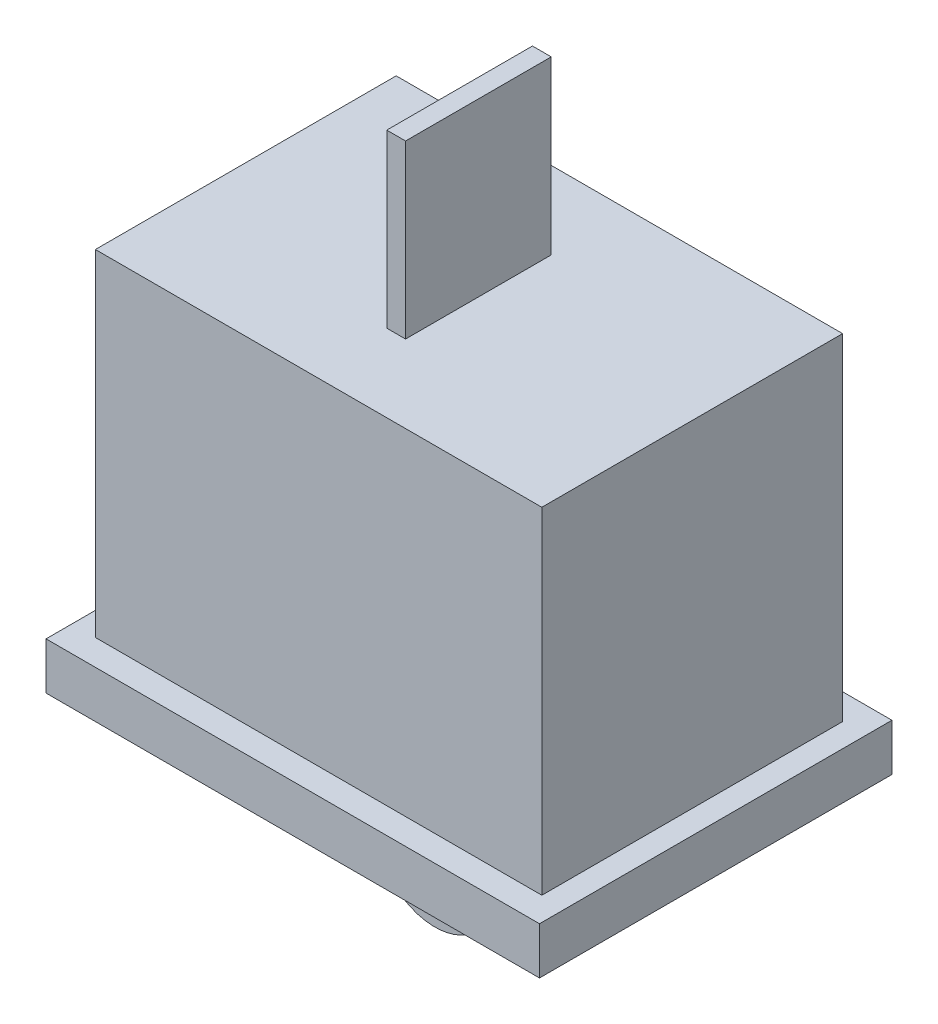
ISO-10303-21;
HEADER;
FILE_DESCRIPTION(('STEP AP214'),'2;1');
FILE_NAME('part.step','',(''),(''),'','','');
FILE_SCHEMA(('AUTOMOTIVE_DESIGN { 1 0 10303 214 1 1 1 1 }'));
ENDSEC;
DATA;
#1=APPLICATION_CONTEXT('core data for automotive mechanical design processes');
#2=APPLICATION_PROTOCOL_DEFINITION('international standard','automotive_design',2000,#1);
#3=PRODUCT_CONTEXT('',#1,'mechanical');
#4=PRODUCT('Part','Part','',(#3));
#5=PRODUCT_RELATED_PRODUCT_CATEGORY('part','',(#4));
#6=PRODUCT_DEFINITION_FORMATION('','',#4);
#7=PRODUCT_DEFINITION_CONTEXT('part definition',#1,'design');
#8=PRODUCT_DEFINITION('design','',#6,#7);
#9=PRODUCT_DEFINITION_SHAPE('','',#8);
#10=(LENGTH_UNIT() NAMED_UNIT(*) SI_UNIT(.MILLI.,.METRE.));
#11=(NAMED_UNIT(*) PLANE_ANGLE_UNIT() SI_UNIT($,.RADIAN.));
#12=(NAMED_UNIT(*) SI_UNIT($,.STERADIAN.) SOLID_ANGLE_UNIT());
#13=UNCERTAINTY_MEASURE_WITH_UNIT(LENGTH_MEASURE(1.E-05),#10,'distance_accuracy_value','');
#14=(GEOMETRIC_REPRESENTATION_CONTEXT(3) GLOBAL_UNCERTAINTY_ASSIGNED_CONTEXT((#13)) GLOBAL_UNIT_ASSIGNED_CONTEXT((#10,
#11,#12)) REPRESENTATION_CONTEXT('',''));
#15=CARTESIAN_POINT('',(0.,0.,0.));
#16=DIRECTION('',(0.,0.,1.));
#17=DIRECTION('',(1.,0.,0.));
#18=AXIS2_PLACEMENT_3D('',#15,#16,#17);
#19=CARTESIAN_POINT('',(0.,16.3,0.));
#20=DIRECTION('',(0.,1.,0.));
#21=DIRECTION('',(0.,0.,1.));
#22=AXIS2_PLACEMENT_3D('',#19,#20,#21);
#23=PLANE('',#22);
#24=DIRECTION('',(0.,0.,-1.));
#25=VECTOR('',#24,1.);
#26=CARTESIAN_POINT('',(9.5,16.3,-6.4));
#27=LINE('',#26,#25);
#28=CARTESIAN_POINT('',(9.5,16.3,6.4));
#29=VERTEX_POINT('',#28);
#30=CARTESIAN_POINT('',(9.5,16.3,-6.4));
#31=VERTEX_POINT('',#30);
#32=EDGE_CURVE('E198',#29,#31,#27,.T.);
#33=ORIENTED_EDGE('',*,*,#32,.T.);
#34=DIRECTION('',(-1.,0.,0.));
#35=VECTOR('',#34,1.);
#36=CARTESIAN_POINT('',(-9.5,16.3,-6.4));
#37=LINE('',#36,#35);
#38=CARTESIAN_POINT('',(-9.5,16.3,-6.4));
#39=VERTEX_POINT('',#38);
#40=EDGE_CURVE('E201',#31,#39,#37,.T.);
#41=ORIENTED_EDGE('',*,*,#40,.T.);
#42=DIRECTION('',(0.,0.,1.));
#43=VECTOR('',#42,1.);
#44=CARTESIAN_POINT('',(-9.5,16.3,-6.4));
#45=LINE('',#44,#43);
#46=CARTESIAN_POINT('',(-9.5,16.3,6.4));
#47=VERTEX_POINT('',#46);
#48=EDGE_CURVE('E204',#39,#47,#45,.T.);
#49=ORIENTED_EDGE('',*,*,#48,.T.);
#50=DIRECTION('',(1.,0.,0.));
#51=VECTOR('',#50,1.);
#52=CARTESIAN_POINT('',(-9.5,16.3,6.4));
#53=LINE('',#52,#51);
#54=EDGE_CURVE('E206',#47,#29,#53,.T.);
#55=ORIENTED_EDGE('',*,*,#54,.T.);
#56=EDGE_LOOP('',(#33,#41,#49,#55));
#57=FACE_BOUND('',#56,.T.);
#58=DIRECTION('',(-1.,0.,0.));
#59=VECTOR('',#58,1.);
#60=CARTESIAN_POINT('',(-0.400000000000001,16.3,-3.1));
#61=LINE('',#60,#59);
#62=CARTESIAN_POINT('',(0.4,16.3,-3.1));
#63=VERTEX_POINT('',#62);
#64=CARTESIAN_POINT('',(-0.400000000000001,16.3,-3.1));
#65=VERTEX_POINT('',#64);
#66=EDGE_CURVE('E167',#63,#65,#61,.T.);
#67=ORIENTED_EDGE('',*,*,#66,.F.);
#68=DIRECTION('',(0.,0.,-1.));
#69=VECTOR('',#68,1.);
#70=CARTESIAN_POINT('',(0.4,16.3,-3.1));
#71=LINE('',#70,#69);
#72=CARTESIAN_POINT('',(0.4,16.3,3.1));
#73=VERTEX_POINT('',#72);
#74=EDGE_CURVE('E164',#73,#63,#71,.T.);
#75=ORIENTED_EDGE('',*,*,#74,.F.);
#76=DIRECTION('',(1.,0.,0.));
#77=VECTOR('',#76,1.);
#78=CARTESIAN_POINT('',(-0.4,16.3,3.1));
#79=LINE('',#78,#77);
#80=CARTESIAN_POINT('',(-0.4,16.3,3.1));
#81=VERTEX_POINT('',#80);
#82=EDGE_CURVE('E176',#81,#73,#79,.T.);
#83=ORIENTED_EDGE('',*,*,#82,.F.);
#84=DIRECTION('',(0.,0.,1.));
#85=VECTOR('',#84,1.);
#86=CARTESIAN_POINT('',(-0.400000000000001,16.3,-3.1));
#87=LINE('',#86,#85);
#88=EDGE_CURVE('E184',#65,#81,#87,.T.);
#89=ORIENTED_EDGE('',*,*,#88,.F.);
#90=EDGE_LOOP('',(#67,#75,#83,#89));
#91=FACE_BOUND('',#90,.T.);
#92=ADVANCED_FACE('F40',(#57,#91),#23,.T.);
#93=CARTESIAN_POINT('',(10.5,2.,-7.5));
#94=DIRECTION('',(-1.,0.,0.));
#95=DIRECTION('',(0.,0.,1.));
#96=AXIS2_PLACEMENT_3D('',#93,#94,#95);
#97=PLANE('',#96);
#98=DIRECTION('',(0.,0.,-1.));
#99=VECTOR('',#98,1.);
#100=CARTESIAN_POINT('',(10.5,0.,-7.5));
#101=LINE('',#100,#99);
#102=CARTESIAN_POINT('',(10.5,0.,7.5));
#103=VERTEX_POINT('',#102);
#104=CARTESIAN_POINT('',(10.5,0.,-7.5));
#105=VERTEX_POINT('',#104);
#106=EDGE_CURVE('E230',#103,#105,#101,.T.);
#107=ORIENTED_EDGE('',*,*,#106,.T.);
#108=DIRECTION('',(0.,-1.,0.));
#109=VECTOR('',#108,1.);
#110=CARTESIAN_POINT('',(10.5,2.,-7.5));
#111=LINE('',#110,#109);
#112=CARTESIAN_POINT('',(10.5,2.,-7.5));
#113=VERTEX_POINT('',#112);
#114=EDGE_CURVE('E11',#113,#105,#111,.T.);
#115=ORIENTED_EDGE('',*,*,#114,.F.);
#116=DIRECTION('',(0.,0.,-1.));
#117=VECTOR('',#116,1.);
#118=CARTESIAN_POINT('',(10.5,2.,-7.5));
#119=LINE('',#118,#117);
#120=CARTESIAN_POINT('',(10.5,2.,7.5));
#121=VERTEX_POINT('',#120);
#122=EDGE_CURVE('E231',#121,#113,#119,.T.);
#123=ORIENTED_EDGE('',*,*,#122,.F.);
#124=DIRECTION('',(0.,-1.,0.));
#125=VECTOR('',#124,1.);
#126=CARTESIAN_POINT('',(10.5,2.,7.5));
#127=LINE('',#126,#125);
#128=EDGE_CURVE('E241',#121,#103,#127,.T.);
#129=ORIENTED_EDGE('',*,*,#128,.T.);
#130=EDGE_LOOP('',(#107,#115,#123,#129));
#131=FACE_BOUND('',#130,.T.);
#132=ADVANCED_FACE('F42',(#131),#97,.F.);
#133=CARTESIAN_POINT('',(-10.5,2.,-7.5));
#134=DIRECTION('',(0.,0.,1.));
#135=DIRECTION('',(1.,0.,0.));
#136=AXIS2_PLACEMENT_3D('',#133,#134,#135);
#137=PLANE('',#136);
#138=DIRECTION('',(-1.,0.,0.));
#139=VECTOR('',#138,1.);
#140=CARTESIAN_POINT('',(-10.5,0.,-7.5));
#141=LINE('',#140,#139);
#142=CARTESIAN_POINT('',(-10.5,0.,-7.5));
#143=VERTEX_POINT('',#142);
#144=EDGE_CURVE('E244',#105,#143,#141,.T.);
#145=ORIENTED_EDGE('',*,*,#144,.T.);
#146=DIRECTION('',(0.,-1.,0.));
#147=VECTOR('',#146,1.);
#148=CARTESIAN_POINT('',(-10.5,2.,-7.5));
#149=LINE('',#148,#147);
#150=CARTESIAN_POINT('',(-10.5,2.,-7.5));
#151=VERTEX_POINT('',#150);
#152=EDGE_CURVE('E48',#151,#143,#149,.T.);
#153=ORIENTED_EDGE('',*,*,#152,.F.);
#154=DIRECTION('',(-1.,0.,0.));
#155=VECTOR('',#154,1.);
#156=CARTESIAN_POINT('',(-10.5,2.,-7.5));
#157=LINE('',#156,#155);
#158=EDGE_CURVE('E234',#113,#151,#157,.T.);
#159=ORIENTED_EDGE('',*,*,#158,.F.);
#160=ORIENTED_EDGE('',*,*,#114,.T.);
#161=EDGE_LOOP('',(#145,#153,#159,#160));
#162=FACE_BOUND('',#161,.T.);
#163=ADVANCED_FACE('F274',(#162),#137,.F.);
#164=CARTESIAN_POINT('',(-10.5,2.,-7.5));
#165=DIRECTION('',(1.,0.,0.));
#166=DIRECTION('',(0.,0.,-1.));
#167=AXIS2_PLACEMENT_3D('',#164,#165,#166);
#168=PLANE('',#167);
#169=DIRECTION('',(0.,0.,1.));
#170=VECTOR('',#169,1.);
#171=CARTESIAN_POINT('',(-10.5,0.,-7.5));
#172=LINE('',#171,#170);
#173=CARTESIAN_POINT('',(-10.5,0.,7.5));
#174=VERTEX_POINT('',#173);
#175=EDGE_CURVE('E246',#143,#174,#172,.T.);
#176=ORIENTED_EDGE('',*,*,#175,.T.);
#177=DIRECTION('',(0.,-1.,0.));
#178=VECTOR('',#177,1.);
#179=CARTESIAN_POINT('',(-10.5,2.,7.5));
#180=LINE('',#179,#178);
#181=CARTESIAN_POINT('',(-10.5,2.,7.5));
#182=VERTEX_POINT('',#181);
#183=EDGE_CURVE('E251',#182,#174,#180,.T.);
#184=ORIENTED_EDGE('',*,*,#183,.F.);
#185=DIRECTION('',(0.,0.,1.));
#186=VECTOR('',#185,1.);
#187=CARTESIAN_POINT('',(-10.5,2.,-7.5));
#188=LINE('',#187,#186);
#189=EDGE_CURVE('E237',#151,#182,#188,.T.);
#190=ORIENTED_EDGE('',*,*,#189,.F.);
#191=ORIENTED_EDGE('',*,*,#152,.T.);
#192=EDGE_LOOP('',(#176,#184,#190,#191));
#193=FACE_BOUND('',#192,.T.);
#194=ADVANCED_FACE('F258',(#193),#168,.F.);
#195=CARTESIAN_POINT('',(-10.5,2.,7.5));
#196=DIRECTION('',(0.,0.,-1.));
#197=DIRECTION('',(-1.,0.,0.));
#198=AXIS2_PLACEMENT_3D('',#195,#196,#197);
#199=PLANE('',#198);
#200=DIRECTION('',(1.,0.,0.));
#201=VECTOR('',#200,1.);
#202=CARTESIAN_POINT('',(-10.5,0.,7.5));
#203=LINE('',#202,#201);
#204=EDGE_CURVE('E235',#174,#103,#203,.T.);
#205=ORIENTED_EDGE('',*,*,#204,.T.);
#206=ORIENTED_EDGE('',*,*,#128,.F.);
#207=DIRECTION('',(1.,0.,0.));
#208=VECTOR('',#207,1.);
#209=CARTESIAN_POINT('',(-10.5,2.,7.5));
#210=LINE('',#209,#208);
#211=EDGE_CURVE('E239',#182,#121,#210,.T.);
#212=ORIENTED_EDGE('',*,*,#211,.F.);
#213=ORIENTED_EDGE('',*,*,#183,.T.);
#214=EDGE_LOOP('',(#205,#206,#212,#213));
#215=FACE_BOUND('',#214,.T.);
#216=ADVANCED_FACE('F267',(#215),#199,.F.);
#217=CARTESIAN_POINT('',(0.,2.,0.));
#218=DIRECTION('',(0.,1.,0.));
#219=DIRECTION('',(0.,0.,1.));
#220=AXIS2_PLACEMENT_3D('',#217,#218,#219);
#221=PLANE('',#220);
#222=DIRECTION('',(0.,0.,-1.));
#223=VECTOR('',#222,1.);
#224=CARTESIAN_POINT('',(9.5,2.,-6.4));
#225=LINE('',#224,#223);
#226=CARTESIAN_POINT('',(9.5,2.,6.4));
#227=VERTEX_POINT('',#226);
#228=CARTESIAN_POINT('',(9.5,2.,-6.4));
#229=VERTEX_POINT('',#228);
#230=EDGE_CURVE('E197',#227,#229,#225,.T.);
#231=ORIENTED_EDGE('',*,*,#230,.F.);
#232=DIRECTION('',(1.,0.,0.));
#233=VECTOR('',#232,1.);
#234=CARTESIAN_POINT('',(-9.5,2.,6.4));
#235=LINE('',#234,#233);
#236=CARTESIAN_POINT('',(-9.5,2.,6.4));
#237=VERTEX_POINT('',#236);
#238=EDGE_CURVE('E202',#237,#227,#235,.T.);
#239=ORIENTED_EDGE('',*,*,#238,.F.);
#240=DIRECTION('',(0.,0.,1.));
#241=VECTOR('',#240,1.);
#242=CARTESIAN_POINT('',(-9.5,2.,-6.4));
#243=LINE('',#242,#241);
#244=CARTESIAN_POINT('',(-9.5,2.,-6.4));
#245=VERTEX_POINT('',#244);
#246=EDGE_CURVE('E214',#245,#237,#243,.T.);
#247=ORIENTED_EDGE('',*,*,#246,.F.);
#248=DIRECTION('',(-1.,0.,0.));
#249=VECTOR('',#248,1.);
#250=CARTESIAN_POINT('',(-9.5,2.,-6.4));
#251=LINE('',#250,#249);
#252=EDGE_CURVE('E211',#229,#245,#251,.T.);
#253=ORIENTED_EDGE('',*,*,#252,.F.);
#254=EDGE_LOOP('',(#231,#239,#247,#253));
#255=FACE_BOUND('',#254,.T.);
#256=ORIENTED_EDGE('',*,*,#122,.T.);
#257=ORIENTED_EDGE('',*,*,#158,.T.);
#258=ORIENTED_EDGE('',*,*,#189,.T.);
#259=ORIENTED_EDGE('',*,*,#211,.T.);
#260=EDGE_LOOP('',(#256,#257,#258,#259));
#261=FACE_BOUND('',#260,.T.);
#262=ADVANCED_FACE('F273',(#255,#261),#221,.T.);
#263=CARTESIAN_POINT('',(0.,0.,0.));
#264=DIRECTION('',(0.,1.,0.));
#265=DIRECTION('',(0.,0.,1.));
#266=AXIS2_PLACEMENT_3D('',#263,#264,#265);
#267=PLANE('',#266);
#268=DIRECTION('',(0.,0.,-1.));
#269=VECTOR('',#268,1.);
#270=CARTESIAN_POINT('',(-4.6658842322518,0.,5.));
#271=LINE('',#270,#269);
#272=CARTESIAN_POINT('',(-4.6658842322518,0.,5.));
#273=VERTEX_POINT('',#272);
#274=CARTESIAN_POINT('',(-4.6658842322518,0.,-5.));
#275=VERTEX_POINT('',#274);
#276=EDGE_CURVE('E55',#273,#275,#271,.T.);
#277=ORIENTED_EDGE('',*,*,#276,.F.);
#278=DIRECTION('',(-1.,0.,0.));
#279=VECTOR('',#278,1.);
#280=CARTESIAN_POINT('',(-4.6658842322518,0.,5.));
#281=LINE('',#280,#279);
#282=CARTESIAN_POINT('',(6.05368569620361,0.,5.));
#283=VERTEX_POINT('',#282);
#284=EDGE_CURVE('E59',#283,#273,#281,.T.);
#285=ORIENTED_EDGE('',*,*,#284,.F.);
#286=DIRECTION('',(0.,0.,-1.));
#287=VECTOR('',#286,1.);
#288=CARTESIAN_POINT('',(6.05368569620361,0.,5.));
#289=LINE('',#288,#287);
#290=CARTESIAN_POINT('',(6.05368569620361,0.,-5.));
#291=VERTEX_POINT('',#290);
#292=EDGE_CURVE('E152',#283,#291,#289,.T.);
#293=ORIENTED_EDGE('',*,*,#292,.T.);
#294=DIRECTION('',(-1.,0.,0.));
#295=VECTOR('',#294,1.);
#296=CARTESIAN_POINT('',(-4.6658842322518,0.,-5.));
#297=LINE('',#296,#295);
#298=EDGE_CURVE('E159',#291,#275,#297,.T.);
#299=ORIENTED_EDGE('',*,*,#298,.T.);
#300=EDGE_LOOP('',(#277,#285,#293,#299));
#301=FACE_BOUND('',#300,.T.);
#302=ORIENTED_EDGE('',*,*,#106,.F.);
#303=ORIENTED_EDGE('',*,*,#204,.F.);
#304=ORIENTED_EDGE('',*,*,#175,.F.);
#305=ORIENTED_EDGE('',*,*,#144,.F.);
#306=EDGE_LOOP('',(#302,#303,#304,#305));
#307=FACE_BOUND('',#306,.T.);
#308=ADVANCED_FACE('F264',(#301,#307),#267,.F.);
#309=CARTESIAN_POINT('',(9.5,16.3,-6.4));
#310=DIRECTION('',(-1.,0.,0.));
#311=DIRECTION('',(0.,0.,1.));
#312=AXIS2_PLACEMENT_3D('',#309,#310,#311);
#313=PLANE('',#312);
#314=ORIENTED_EDGE('',*,*,#230,.T.);
#315=DIRECTION('',(0.,-1.,0.));
#316=VECTOR('',#315,1.);
#317=CARTESIAN_POINT('',(9.5,16.3,-6.4));
#318=LINE('',#317,#316);
#319=EDGE_CURVE('E227',#31,#229,#318,.T.);
#320=ORIENTED_EDGE('',*,*,#319,.F.);
#321=ORIENTED_EDGE('',*,*,#32,.F.);
#322=DIRECTION('',(0.,-1.,0.));
#323=VECTOR('',#322,1.);
#324=CARTESIAN_POINT('',(9.5,16.3,6.4));
#325=LINE('',#324,#323);
#326=EDGE_CURVE('E208',#29,#227,#325,.T.);
#327=ORIENTED_EDGE('',*,*,#326,.T.);
#328=EDGE_LOOP('',(#314,#320,#321,#327));
#329=FACE_BOUND('',#328,.T.);
#330=ADVANCED_FACE('F302',(#329),#313,.F.);
#331=CARTESIAN_POINT('',(-9.5,16.3,-6.4));
#332=DIRECTION('',(0.,0.,1.));
#333=DIRECTION('',(1.,0.,0.));
#334=AXIS2_PLACEMENT_3D('',#331,#332,#333);
#335=PLANE('',#334);
#336=ORIENTED_EDGE('',*,*,#252,.T.);
#337=DIRECTION('',(0.,-1.,0.));
#338=VECTOR('',#337,1.);
#339=CARTESIAN_POINT('',(-9.5,16.3,-6.4));
#340=LINE('',#339,#338);
#341=EDGE_CURVE('E224',#39,#245,#340,.T.);
#342=ORIENTED_EDGE('',*,*,#341,.F.);
#343=ORIENTED_EDGE('',*,*,#40,.F.);
#344=ORIENTED_EDGE('',*,*,#319,.T.);
#345=EDGE_LOOP('',(#336,#342,#343,#344));
#346=FACE_BOUND('',#345,.T.);
#347=ADVANCED_FACE('F298',(#346),#335,.F.);
#348=CARTESIAN_POINT('',(-9.5,16.3,-6.4));
#349=DIRECTION('',(1.,0.,0.));
#350=DIRECTION('',(0.,0.,-1.));
#351=AXIS2_PLACEMENT_3D('',#348,#349,#350);
#352=PLANE('',#351);
#353=ORIENTED_EDGE('',*,*,#246,.T.);
#354=DIRECTION('',(0.,-1.,0.));
#355=VECTOR('',#354,1.);
#356=CARTESIAN_POINT('',(-9.5,16.3,6.4));
#357=LINE('',#356,#355);
#358=EDGE_CURVE('E221',#47,#237,#357,.T.);
#359=ORIENTED_EDGE('',*,*,#358,.F.);
#360=ORIENTED_EDGE('',*,*,#48,.F.);
#361=ORIENTED_EDGE('',*,*,#341,.T.);
#362=EDGE_LOOP('',(#353,#359,#360,#361));
#363=FACE_BOUND('',#362,.T.);
#364=ADVANCED_FACE('F294',(#363),#352,.F.);
#365=CARTESIAN_POINT('',(-9.5,16.3,6.4));
#366=DIRECTION('',(0.,0.,-1.));
#367=DIRECTION('',(-1.,0.,0.));
#368=AXIS2_PLACEMENT_3D('',#365,#366,#367);
#369=PLANE('',#368);
#370=ORIENTED_EDGE('',*,*,#238,.T.);
#371=ORIENTED_EDGE('',*,*,#326,.F.);
#372=ORIENTED_EDGE('',*,*,#54,.F.);
#373=ORIENTED_EDGE('',*,*,#358,.T.);
#374=EDGE_LOOP('',(#370,#371,#372,#373));
#375=FACE_BOUND('',#374,.T.);
#376=ADVANCED_FACE('F291',(#375),#369,.F.);
#377=CARTESIAN_POINT('',(0.4,23.6,-3.1));
#378=DIRECTION('',(-1.,0.,0.));
#379=DIRECTION('',(0.,0.,1.));
#380=AXIS2_PLACEMENT_3D('',#377,#378,#379);
#381=PLANE('',#380);
#382=ORIENTED_EDGE('',*,*,#74,.T.);
#383=DIRECTION('',(0.,-1.,0.));
#384=VECTOR('',#383,1.);
#385=CARTESIAN_POINT('',(0.4,23.6,-3.1));
#386=LINE('',#385,#384);
#387=CARTESIAN_POINT('',(0.4,23.6,-3.1));
#388=VERTEX_POINT('',#387);
#389=EDGE_CURVE('E195',#388,#63,#386,.T.);
#390=ORIENTED_EDGE('',*,*,#389,.F.);
#391=DIRECTION('',(0.,0.,-1.));
#392=VECTOR('',#391,1.);
#393=CARTESIAN_POINT('',(0.4,23.6,-3.1));
#394=LINE('',#393,#392);
#395=CARTESIAN_POINT('',(0.4,23.6,3.1));
#396=VERTEX_POINT('',#395);
#397=EDGE_CURVE('E172',#396,#388,#394,.T.);
#398=ORIENTED_EDGE('',*,*,#397,.F.);
#399=DIRECTION('',(0.,-1.,0.));
#400=VECTOR('',#399,1.);
#401=CARTESIAN_POINT('',(0.4,23.6,3.1));
#402=LINE('',#401,#400);
#403=EDGE_CURVE('E181',#396,#73,#402,.T.);
#404=ORIENTED_EDGE('',*,*,#403,.T.);
#405=EDGE_LOOP('',(#382,#390,#398,#404));
#406=FACE_BOUND('',#405,.T.);
#407=ADVANCED_FACE('F289',(#406),#381,.F.);
#408=CARTESIAN_POINT('',(-0.400000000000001,23.6,-3.1));
#409=DIRECTION('',(0.,0.,1.));
#410=DIRECTION('',(1.,0.,0.));
#411=AXIS2_PLACEMENT_3D('',#408,#409,#410);
#412=PLANE('',#411);
#413=ORIENTED_EDGE('',*,*,#66,.T.);
#414=DIRECTION('',(0.,-1.,0.));
#415=VECTOR('',#414,1.);
#416=CARTESIAN_POINT('',(-0.400000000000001,23.6,-3.1));
#417=LINE('',#416,#415);
#418=CARTESIAN_POINT('',(-0.400000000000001,23.6,-3.1));
#419=VERTEX_POINT('',#418);
#420=EDGE_CURVE('E192',#419,#65,#417,.T.);
#421=ORIENTED_EDGE('',*,*,#420,.F.);
#422=DIRECTION('',(-1.,0.,0.));
#423=VECTOR('',#422,1.);
#424=CARTESIAN_POINT('',(-0.400000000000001,23.6,-3.1));
#425=LINE('',#424,#423);
#426=EDGE_CURVE('E175',#388,#419,#425,.T.);
#427=ORIENTED_EDGE('',*,*,#426,.F.);
#428=ORIENTED_EDGE('',*,*,#389,.T.);
#429=EDGE_LOOP('',(#413,#421,#427,#428));
#430=FACE_BOUND('',#429,.T.);
#431=ADVANCED_FACE('F349',(#430),#412,.F.);
#432=CARTESIAN_POINT('',(-0.400000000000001,23.6,-3.1));
#433=DIRECTION('',(1.,0.,0.));
#434=DIRECTION('',(0.,0.,-1.));
#435=AXIS2_PLACEMENT_3D('',#432,#433,#434);
#436=PLANE('',#435);
#437=ORIENTED_EDGE('',*,*,#88,.T.);
#438=DIRECTION('',(0.,-1.,0.));
#439=VECTOR('',#438,1.);
#440=CARTESIAN_POINT('',(-0.4,23.6,3.1));
#441=LINE('',#440,#439);
#442=CARTESIAN_POINT('',(-0.4,23.6,3.1));
#443=VERTEX_POINT('',#442);
#444=EDGE_CURVE('E190',#443,#81,#441,.T.);
#445=ORIENTED_EDGE('',*,*,#444,.F.);
#446=DIRECTION('',(0.,0.,1.));
#447=VECTOR('',#446,1.);
#448=CARTESIAN_POINT('',(-0.400000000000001,23.6,-3.1));
#449=LINE('',#448,#447);
#450=EDGE_CURVE('E178',#419,#443,#449,.T.);
#451=ORIENTED_EDGE('',*,*,#450,.F.);
#452=ORIENTED_EDGE('',*,*,#420,.T.);
#453=EDGE_LOOP('',(#437,#445,#451,#452));
#454=FACE_BOUND('',#453,.T.);
#455=ADVANCED_FACE('F356',(#454),#436,.F.);
#456=CARTESIAN_POINT('',(-0.4,23.6,3.1));
#457=DIRECTION('',(0.,0.,-1.));
#458=DIRECTION('',(-1.,0.,0.));
#459=AXIS2_PLACEMENT_3D('',#456,#457,#458);
#460=PLANE('',#459);
#461=ORIENTED_EDGE('',*,*,#82,.T.);
#462=ORIENTED_EDGE('',*,*,#403,.F.);
#463=DIRECTION('',(1.,0.,0.));
#464=VECTOR('',#463,1.);
#465=CARTESIAN_POINT('',(-0.4,23.6,3.1));
#466=LINE('',#465,#464);
#467=EDGE_CURVE('E180',#443,#396,#466,.T.);
#468=ORIENTED_EDGE('',*,*,#467,.F.);
#469=ORIENTED_EDGE('',*,*,#444,.T.);
#470=EDGE_LOOP('',(#461,#462,#468,#469));
#471=FACE_BOUND('',#470,.T.);
#472=ADVANCED_FACE('F363',(#471),#460,.F.);
#473=CARTESIAN_POINT('',(0.,23.6,0.));
#474=DIRECTION('',(0.,1.,0.));
#475=DIRECTION('',(0.,0.,1.));
#476=AXIS2_PLACEMENT_3D('',#473,#474,#475);
#477=PLANE('',#476);
#478=ORIENTED_EDGE('',*,*,#397,.T.);
#479=ORIENTED_EDGE('',*,*,#426,.T.);
#480=ORIENTED_EDGE('',*,*,#450,.T.);
#481=ORIENTED_EDGE('',*,*,#467,.T.);
#482=EDGE_LOOP('',(#478,#479,#480,#481));
#483=FACE_BOUND('',#482,.T.);
#484=ADVANCED_FACE('F371',(#483),#477,.T.);
#485=CARTESIAN_POINT('',(-4.6658842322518,-10.736622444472,5.));
#486=DIRECTION('',(0.,0.,-1.));
#487=DIRECTION('',(-1.,0.,0.));
#488=AXIS2_PLACEMENT_3D('',#485,#486,#487);
#489=CYLINDRICAL_SURFACE('',#488,10.736622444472);
#490=CARTESIAN_POINT('',(-4.6658842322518,-10.736622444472,-5.));
#491=DIRECTION('',(0.,0.,-1.));
#492=DIRECTION('',(1.,0.,0.));
#493=AXIS2_PLACEMENT_3D('',#490,#491,#492);
#494=CIRCLE('',#493,10.736622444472);
#495=CARTESIAN_POINT('',(1.98252295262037,-2.30609794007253,-5.));
#496=VERTEX_POINT('',#495);
#497=EDGE_CURVE('E163',#275,#496,#494,.T.);
#498=ORIENTED_EDGE('',*,*,#497,.T.);
#499=DIRECTION('',(0.,0.,-1.));
#500=VECTOR('',#499,1.);
#501=CARTESIAN_POINT('',(1.98252295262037,-2.30609794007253,5.));
#502=LINE('',#501,#500);
#503=CARTESIAN_POINT('',(1.98252295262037,-2.30609794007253,5.));
#504=VERTEX_POINT('',#503);
#505=EDGE_CURVE('E150',#504,#496,#502,.T.);
#506=ORIENTED_EDGE('',*,*,#505,.F.);
#507=CARTESIAN_POINT('',(-4.6658842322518,-10.736622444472,5.));
#508=DIRECTION('',(0.,0.,-1.));
#509=DIRECTION('',(1.,0.,0.));
#510=AXIS2_PLACEMENT_3D('',#507,#508,#509);
#511=CIRCLE('',#510,10.736622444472);
#512=EDGE_CURVE('E154',#273,#504,#511,.T.);
#513=ORIENTED_EDGE('',*,*,#512,.F.);
#514=ORIENTED_EDGE('',*,*,#276,.T.);
#515=EDGE_LOOP('',(#498,#506,#513,#514));
#516=FACE_BOUND('',#515,.T.);
#517=ADVANCED_FACE('F161',(#516),#489,.F.);
#518=CARTESIAN_POINT('',(3.5472947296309,-0.321886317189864,5.));
#519=DIRECTION('',(0.,0.,-1.));
#520=DIRECTION('',(-1.,0.,0.));
#521=AXIS2_PLACEMENT_3D('',#518,#519,#520);
#522=CYLINDRICAL_SURFACE('',#521,2.52697575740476);
#523=CARTESIAN_POINT('',(3.5472947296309,-0.321886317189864,-5.));
#524=DIRECTION('',(0.,0.,1.));
#525=DIRECTION('',(1.,0.,0.));
#526=AXIS2_PLACEMENT_3D('',#523,#524,#525);
#527=CIRCLE('',#526,2.52697575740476);
#528=EDGE_CURVE('E505',#496,#291,#527,.T.);
#529=ORIENTED_EDGE('',*,*,#528,.T.);
#530=ORIENTED_EDGE('',*,*,#292,.F.);
#531=CARTESIAN_POINT('',(3.5472947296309,-0.321886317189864,5.));
#532=DIRECTION('',(0.,0.,1.));
#533=DIRECTION('',(1.,0.,0.));
#534=AXIS2_PLACEMENT_3D('',#531,#532,#533);
#535=CIRCLE('',#534,2.52697575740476);
#536=EDGE_CURVE('E145',#504,#283,#535,.T.);
#537=ORIENTED_EDGE('',*,*,#536,.F.);
#538=ORIENTED_EDGE('',*,*,#505,.T.);
#539=EDGE_LOOP('',(#529,#530,#537,#538));
#540=FACE_BOUND('',#539,.T.);
#541=ADVANCED_FACE('F148',(#540),#522,.T.);
#542=CARTESIAN_POINT('',(-4.6658842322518,-10.736622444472,5.));
#543=DIRECTION('',(0.,0.,1.));
#544=DIRECTION('',(1.,0.,0.));
#545=AXIS2_PLACEMENT_3D('',#542,#543,#544);
#546=PLANE('',#545);
#547=ORIENTED_EDGE('',*,*,#512,.T.);
#548=ORIENTED_EDGE('',*,*,#536,.T.);
#549=ORIENTED_EDGE('',*,*,#284,.T.);
#550=EDGE_LOOP('',(#547,#548,#549));
#551=FACE_BOUND('',#550,.T.);
#552=ADVANCED_FACE('F157',(#551),#546,.T.);
#553=CARTESIAN_POINT('',(-4.6658842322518,-10.736622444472,-5.));
#554=DIRECTION('',(0.,0.,1.));
#555=DIRECTION('',(1.,0.,0.));
#556=AXIS2_PLACEMENT_3D('',#553,#554,#555);
#557=PLANE('',#556);
#558=ORIENTED_EDGE('',*,*,#497,.F.);
#559=ORIENTED_EDGE('',*,*,#298,.F.);
#560=ORIENTED_EDGE('',*,*,#528,.F.);
#561=EDGE_LOOP('',(#558,#559,#560));
#562=FACE_BOUND('',#561,.T.);
#563=ADVANCED_FACE('F396',(#562),#557,.F.);
#564=CLOSED_SHELL('',(#92,#132,#163,#194,#216,#262,#308,#330,#347,#364,#376,#407,#431,#455,#472,
#484,#517,#541,#552,#563));
#565=MANIFOLD_SOLID_BREP('B2',#564);
#566=ADVANCED_BREP_SHAPE_REPRESENTATION('',(#18,#565),#14);
#567=SHAPE_DEFINITION_REPRESENTATION(#9,#566);
ENDSEC;
END-ISO-10303-21;
